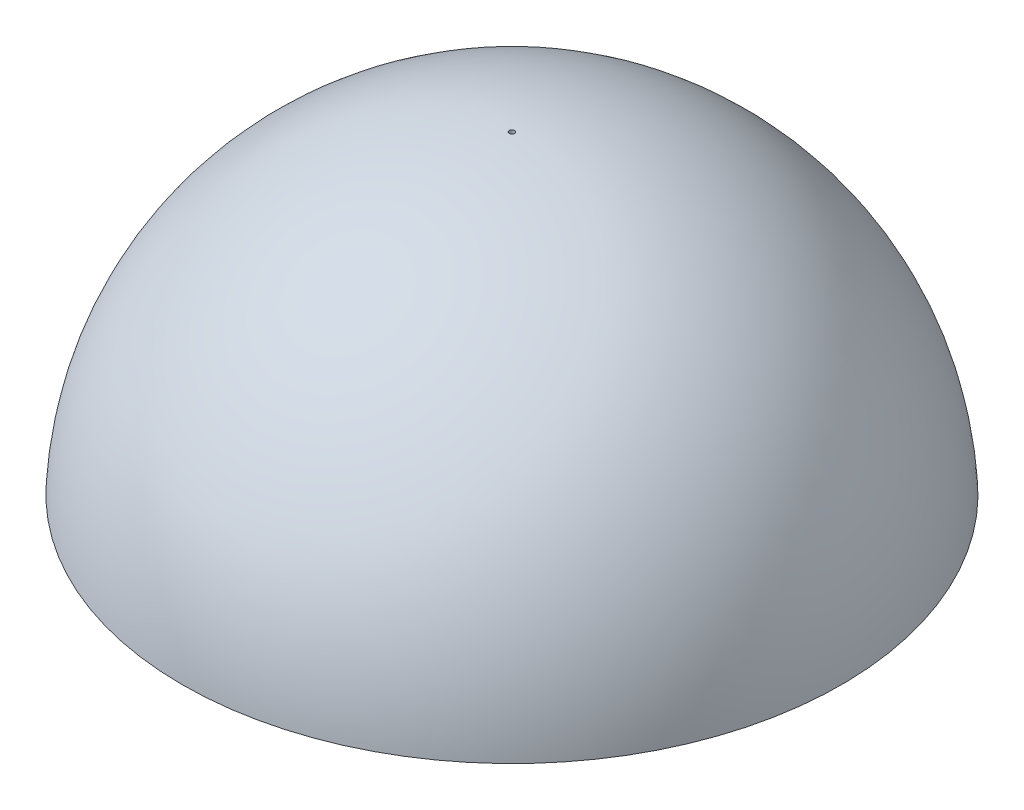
ISO-10303-21;
HEADER;
FILE_DESCRIPTION(('STEP AP214'),'2;1');
FILE_NAME('part.step','',(''),(''),'','','');
FILE_SCHEMA(('AUTOMOTIVE_DESIGN { 1 0 10303 214 1 1 1 1 }'));
ENDSEC;
DATA;
#1=APPLICATION_CONTEXT('core data for automotive mechanical design processes');
#2=APPLICATION_PROTOCOL_DEFINITION('international standard','automotive_design',2000,#1);
#3=PRODUCT_CONTEXT('',#1,'mechanical');
#4=PRODUCT('Part','Part','',(#3));
#5=PRODUCT_RELATED_PRODUCT_CATEGORY('part','',(#4));
#6=PRODUCT_DEFINITION_FORMATION('','',#4);
#7=PRODUCT_DEFINITION_CONTEXT('part definition',#1,'design');
#8=PRODUCT_DEFINITION('design','',#6,#7);
#9=PRODUCT_DEFINITION_SHAPE('','',#8);
#10=(LENGTH_UNIT() NAMED_UNIT(*) SI_UNIT(.MILLI.,.METRE.));
#11=(NAMED_UNIT(*) PLANE_ANGLE_UNIT() SI_UNIT($,.RADIAN.));
#12=(NAMED_UNIT(*) SI_UNIT($,.STERADIAN.) SOLID_ANGLE_UNIT());
#13=UNCERTAINTY_MEASURE_WITH_UNIT(LENGTH_MEASURE(1.E-05),#10,'distance_accuracy_value','');
#14=(GEOMETRIC_REPRESENTATION_CONTEXT(3) GLOBAL_UNCERTAINTY_ASSIGNED_CONTEXT((#13)) GLOBAL_UNIT_ASSIGNED_CONTEXT((#10,
#11,#12)) REPRESENTATION_CONTEXT('',''));
#15=CARTESIAN_POINT('',(0.,0.,0.));
#16=DIRECTION('',(0.,0.,1.));
#17=DIRECTION('',(1.,0.,0.));
#18=AXIS2_PLACEMENT_3D('',#15,#16,#17);
#19=CARTESIAN_POINT('',(0.,0.,0.));
#20=DIRECTION('',(0.,0.,-1.));
#21=DIRECTION('',(-1.,0.,0.));
#22=AXIS2_PLACEMENT_3D('',#19,#20,#21);
#23=SPHERICAL_SURFACE('',#22,62.);
#24=CARTESIAN_POINT('',(0.,0.,0.));
#25=DIRECTION('',(0.,1.,0.));
#26=DIRECTION('',(0.,0.,1.));
#27=AXIS2_PLACEMENT_3D('',#24,#25,#26);
#28=SPHERICAL_SURFACE('',#27,62.);
#29=CARTESIAN_POINT('',(0.,3.,0.));
#30=DIRECTION('',(0.,1.,0.));
#31=DIRECTION('',(0.,0.,1.));
#32=AXIS2_PLACEMENT_3D('',#29,#30,#31);
#33=CIRCLE('',#32,61.9273768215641);
#34=CARTESIAN_POINT('',(0.,3.,61.9273768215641));
#35=VERTEX_POINT('',#34);
#36=EDGE_CURVE('E48',#35,#35,#33,.T.);
#37=ORIENTED_EDGE('',*,*,#36,.T.);
#38=EDGE_LOOP('',(#37));
#39=FACE_BOUND('',#38,.T.);
#40=CARTESIAN_POINT('',(0.,61.9979838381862,0.));
#41=DIRECTION('',(0.,-1.,0.));
#42=DIRECTION('',(0.,0.,-1.));
#43=AXIS2_PLACEMENT_3D('',#40,#41,#42);
#44=CIRCLE('',#43,0.5);
#45=CARTESIAN_POINT('',(0.,61.9979838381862,-0.5));
#46=VERTEX_POINT('',#45);
#47=EDGE_CURVE('E54',#46,#46,#44,.F.);
#48=ORIENTED_EDGE('',*,*,#47,.F.);
#49=EDGE_LOOP('',(#48));
#50=FACE_BOUND('',#49,.T.);
#51=ADVANCED_FACE('F40',(#39,#50),#28,.T.);
#52=CARTESIAN_POINT('',(0.,0.,0.));
#53=DIRECTION('',(0.,0.,-1.));
#54=DIRECTION('',(-1.,0.,0.));
#55=AXIS2_PLACEMENT_3D('',#52,#53,#54);
#56=SPHERICAL_SURFACE('',#55,60.);
#57=CARTESIAN_POINT('',(0.,0.,0.));
#58=DIRECTION('',(0.,1.,0.));
#59=DIRECTION('',(0.,0.,1.));
#60=AXIS2_PLACEMENT_3D('',#57,#58,#59);
#61=SPHERICAL_SURFACE('',#60,60.);
#62=CARTESIAN_POINT('',(0.,3.,0.));
#63=DIRECTION('',(0.,1.,0.));
#64=DIRECTION('',(0.,0.,1.));
#65=AXIS2_PLACEMENT_3D('',#62,#63,#64);
#66=CIRCLE('',#65,59.9249530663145);
#67=CARTESIAN_POINT('',(0.,3.,59.9249530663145));
#68=VERTEX_POINT('',#67);
#69=EDGE_CURVE('E10',#68,#68,#66,.T.);
#70=ORIENTED_EDGE('',*,*,#69,.F.);
#71=EDGE_LOOP('',(#70));
#72=FACE_BOUND('',#71,.T.);
#73=CARTESIAN_POINT('',(0.,59.9979166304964,0.));
#74=DIRECTION('',(0.,-1.,0.));
#75=DIRECTION('',(0.,0.,-1.));
#76=AXIS2_PLACEMENT_3D('',#73,#74,#75);
#77=CIRCLE('',#76,0.5);
#78=CARTESIAN_POINT('',(0.,59.9979166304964,-0.5));
#79=VERTEX_POINT('',#78);
#80=EDGE_CURVE('E43',#79,#79,#77,.F.);
#81=ORIENTED_EDGE('',*,*,#80,.T.);
#82=EDGE_LOOP('',(#81));
#83=FACE_BOUND('',#82,.T.);
#84=ADVANCED_FACE('F64',(#72,#83),#61,.F.);
#85=CARTESIAN_POINT('',(0.,3.,0.));
#86=DIRECTION('',(0.,1.,0.));
#87=DIRECTION('',(0.,0.,1.));
#88=AXIS2_PLACEMENT_3D('',#85,#86,#87);
#89=PLANE('',#88);
#90=ORIENTED_EDGE('',*,*,#69,.T.);
#91=EDGE_LOOP('',(#90));
#92=FACE_BOUND('',#91,.T.);
#93=ORIENTED_EDGE('',*,*,#36,.F.);
#94=EDGE_LOOP('',(#93));
#95=FACE_BOUND('',#94,.T.);
#96=ADVANCED_FACE('F68',(#92,#95),#89,.F.);
#97=CARTESIAN_POINT('',(0.,62.,0.));
#98=DIRECTION('',(0.,-1.,0.));
#99=DIRECTION('',(0.,0.,-1.));
#100=AXIS2_PLACEMENT_3D('',#97,#98,#99);
#101=CYLINDRICAL_SURFACE('',#100,0.5);
#102=ORIENTED_EDGE('',*,*,#80,.F.);
#103=EDGE_LOOP('',(#102));
#104=FACE_BOUND('',#103,.T.);
#105=ORIENTED_EDGE('',*,*,#47,.T.);
#106=EDGE_LOOP('',(#105));
#107=FACE_BOUND('',#106,.T.);
#108=ADVANCED_FACE('F66',(#104,#107),#101,.F.);
#109=CLOSED_SHELL('',(#51,#84,#96,#108));
#110=MANIFOLD_SOLID_BREP('B2',#109);
#111=ADVANCED_BREP_SHAPE_REPRESENTATION('',(#18,#110),#14);
#112=SHAPE_DEFINITION_REPRESENTATION(#9,#111);
ENDSEC;
END-ISO-10303-21;
